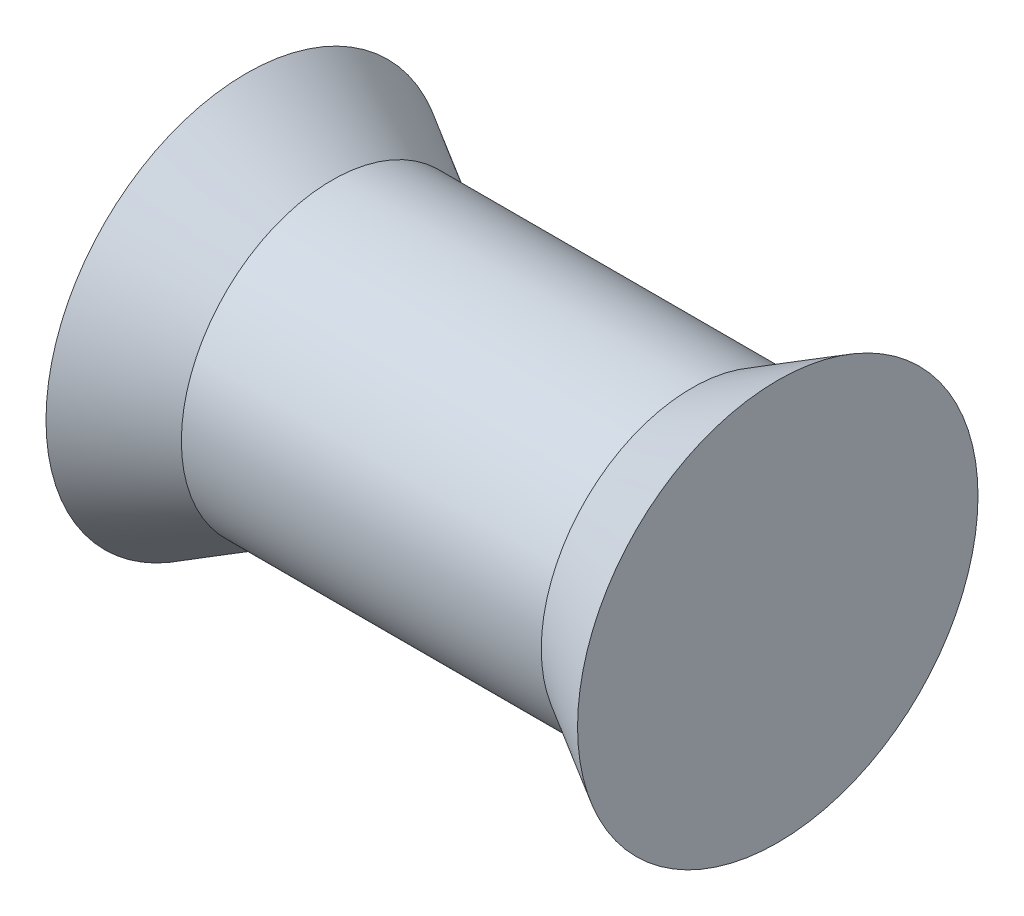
from build123d import *


with BuildPart() as part:
    # Sketch 1 → Revolve 1 (revolve)
    with BuildSketch(Plane.XY, mode=Mode.PRIVATE) as revolve_1_sk:
        Polygon((0, 0), (0, 3.674001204), (-1.5748, 2.76479), (-8.1788, 2.76479), (-9.7536, 3.674001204), (-9.7536, 0), align=None)
    revolve(revolve_1_sk.sketch.rotate(Axis((0, 0, 0), (-1, 0, 0)), 90), axis=Axis((0, 0, 0), (-1, 0, 0)))


solid = part.part
